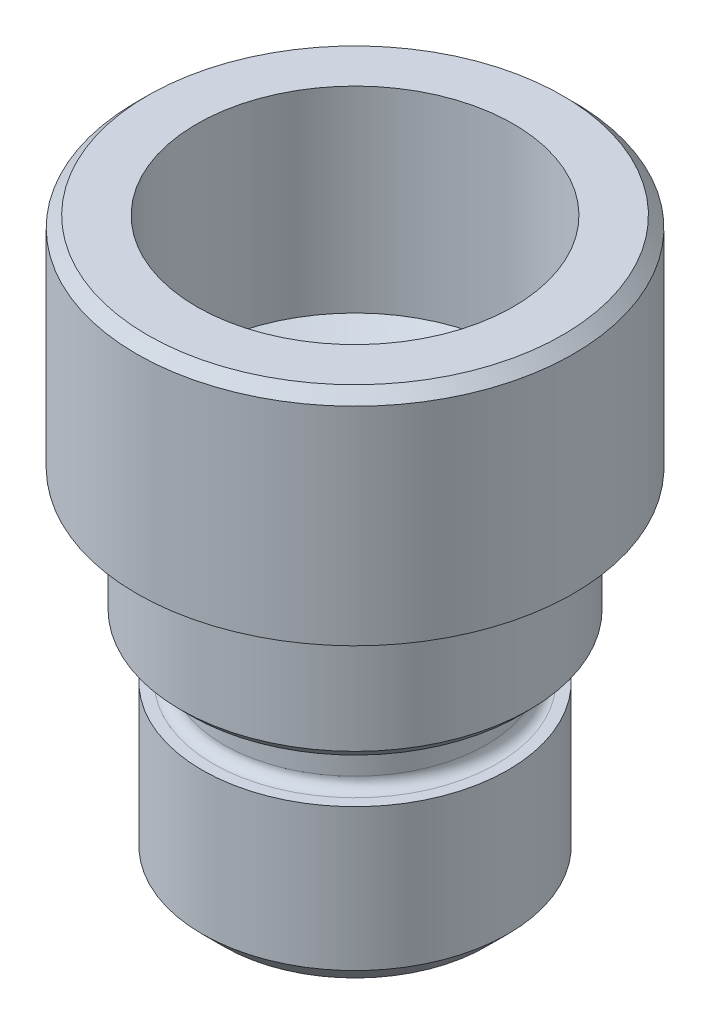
ISO-10303-21;
HEADER;
FILE_DESCRIPTION(('STEP AP214'),'2;1');
FILE_NAME('part.step','',(''),(''),'','','');
FILE_SCHEMA(('AUTOMOTIVE_DESIGN { 1 0 10303 214 1 1 1 1 }'));
ENDSEC;
DATA;
#1=APPLICATION_CONTEXT('core data for automotive mechanical design processes');
#2=APPLICATION_PROTOCOL_DEFINITION('international standard','automotive_design',2000,#1);
#3=PRODUCT_CONTEXT('',#1,'mechanical');
#4=PRODUCT('Part','Part','',(#3));
#5=PRODUCT_RELATED_PRODUCT_CATEGORY('part','',(#4));
#6=PRODUCT_DEFINITION_FORMATION('','',#4);
#7=PRODUCT_DEFINITION_CONTEXT('part definition',#1,'design');
#8=PRODUCT_DEFINITION('design','',#6,#7);
#9=PRODUCT_DEFINITION_SHAPE('','',#8);
#10=(LENGTH_UNIT() NAMED_UNIT(*) SI_UNIT(.MILLI.,.METRE.));
#11=(NAMED_UNIT(*) PLANE_ANGLE_UNIT() SI_UNIT($,.RADIAN.));
#12=(NAMED_UNIT(*) SI_UNIT($,.STERADIAN.) SOLID_ANGLE_UNIT());
#13=UNCERTAINTY_MEASURE_WITH_UNIT(LENGTH_MEASURE(1.E-05),#10,'distance_accuracy_value','');
#14=(GEOMETRIC_REPRESENTATION_CONTEXT(3) GLOBAL_UNCERTAINTY_ASSIGNED_CONTEXT((#13)) GLOBAL_UNIT_ASSIGNED_CONTEXT((#10,
#11,#12)) REPRESENTATION_CONTEXT('',''));
#15=CARTESIAN_POINT('',(0.,0.,0.));
#16=DIRECTION('',(0.,0.,1.));
#17=DIRECTION('',(1.,0.,0.));
#18=AXIS2_PLACEMENT_3D('',#15,#16,#17);
#19=CARTESIAN_POINT('',(0.,8.,0.));
#20=DIRECTION('',(0.,1.,0.));
#21=DIRECTION('',(0.,0.,1.));
#22=AXIS2_PLACEMENT_3D('',#19,#20,#21);
#23=TOROIDAL_SURFACE('',#22,6.5,0.500000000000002);
#24=CARTESIAN_POINT('',(0.,7.5,0.));
#25=DIRECTION('',(0.,1.,0.));
#26=DIRECTION('',(0.,0.,1.));
#27=AXIS2_PLACEMENT_3D('',#24,#25,#26);
#28=CIRCLE('',#27,6.5);
#29=CARTESIAN_POINT('',(0.,7.5,6.5));
#30=VERTEX_POINT('',#29);
#31=EDGE_CURVE('E76',#30,#30,#28,.T.);
#32=ORIENTED_EDGE('',*,*,#31,.T.);
#33=EDGE_LOOP('',(#32));
#34=FACE_BOUND('',#33,.T.);
#35=CARTESIAN_POINT('',(0.,8.,0.));
#36=DIRECTION('',(0.,1.,0.));
#37=DIRECTION('',(0.,0.,1.));
#38=AXIS2_PLACEMENT_3D('',#35,#36,#37);
#39=CIRCLE('',#38,6.);
#40=CARTESIAN_POINT('',(0.,8.,6.));
#41=VERTEX_POINT('',#40);
#42=EDGE_CURVE('E10',#41,#41,#39,.T.);
#43=ORIENTED_EDGE('',*,*,#42,.F.);
#44=EDGE_LOOP('',(#43));
#45=FACE_BOUND('',#44,.T.);
#46=ADVANCED_FACE('F30',(#34,#45),#23,.F.);
#47=CARTESIAN_POINT('',(0.,0.,0.));
#48=DIRECTION('',(0.,1.,0.));
#49=DIRECTION('',(0.,0.,1.));
#50=AXIS2_PLACEMENT_3D('',#47,#48,#49);
#51=CYLINDRICAL_SURFACE('',#50,6.);
#52=ORIENTED_EDGE('',*,*,#42,.T.);
#53=EDGE_LOOP('',(#52));
#54=FACE_BOUND('',#53,.T.);
#55=CARTESIAN_POINT('',(0.,9.4,0.));
#56=DIRECTION('',(0.,1.,0.));
#57=DIRECTION('',(0.,0.,1.));
#58=AXIS2_PLACEMENT_3D('',#55,#56,#57);
#59=CIRCLE('',#58,6.);
#60=CARTESIAN_POINT('',(0.,9.4,6.));
#61=VERTEX_POINT('',#60);
#62=EDGE_CURVE('E37',#61,#61,#59,.T.);
#63=ORIENTED_EDGE('',*,*,#62,.F.);
#64=EDGE_LOOP('',(#63));
#65=FACE_BOUND('',#64,.T.);
#66=ADVANCED_FACE('F107',(#54,#65),#51,.T.);
#67=CARTESIAN_POINT('',(0.,9.4,0.));
#68=DIRECTION('',(0.,1.,0.));
#69=DIRECTION('',(0.,0.,1.));
#70=AXIS2_PLACEMENT_3D('',#67,#68,#69);
#71=TOROIDAL_SURFACE('',#70,6.5,0.5);
#72=ORIENTED_EDGE('',*,*,#62,.T.);
#73=EDGE_LOOP('',(#72));
#74=FACE_BOUND('',#73,.T.);
#75=CARTESIAN_POINT('',(0.,9.9,0.));
#76=DIRECTION('',(0.,1.,0.));
#77=DIRECTION('',(0.,0.,1.));
#78=AXIS2_PLACEMENT_3D('',#75,#76,#77);
#79=CIRCLE('',#78,6.5);
#80=CARTESIAN_POINT('',(0.,9.9,6.5));
#81=VERTEX_POINT('',#80);
#82=EDGE_CURVE('E41',#81,#81,#79,.T.);
#83=ORIENTED_EDGE('',*,*,#82,.F.);
#84=EDGE_LOOP('',(#83));
#85=FACE_BOUND('',#84,.T.);
#86=ADVANCED_FACE('F112',(#74,#85),#71,.F.);
#87=CARTESIAN_POINT('',(7.5,9.9,0.));
#88=DIRECTION('',(0.,-1.,0.));
#89=DIRECTION('',(0.,0.,-1.));
#90=AXIS2_PLACEMENT_3D('',#87,#88,#89);
#91=PLANE('',#90);
#92=ORIENTED_EDGE('',*,*,#82,.T.);
#93=EDGE_LOOP('',(#92));
#94=FACE_BOUND('',#93,.T.);
#95=CARTESIAN_POINT('',(0.,9.9,0.));
#96=DIRECTION('',(0.,1.,0.));
#97=DIRECTION('',(0.,0.,1.));
#98=AXIS2_PLACEMENT_3D('',#95,#96,#97);
#99=CIRCLE('',#98,7.5);
#100=CARTESIAN_POINT('',(0.,9.9,7.5));
#101=VERTEX_POINT('',#100);
#102=EDGE_CURVE('E46',#101,#101,#99,.T.);
#103=ORIENTED_EDGE('',*,*,#102,.F.);
#104=EDGE_LOOP('',(#103));
#105=FACE_BOUND('',#104,.T.);
#106=ADVANCED_FACE('F239',(#94,#105),#91,.T.);
#107=CARTESIAN_POINT('',(0.,10.4,0.));
#108=DIRECTION('',(0.,1.,0.));
#109=DIRECTION('',(0.,0.,1.));
#110=AXIS2_PLACEMENT_3D('',#107,#108,#109);
#111=CONICAL_SURFACE('',#110,8.,0.785398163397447);
#112=ORIENTED_EDGE('',*,*,#102,.T.);
#113=EDGE_LOOP('',(#112));
#114=FACE_BOUND('',#113,.T.);
#115=CARTESIAN_POINT('',(0.,10.4,0.));
#116=DIRECTION('',(0.,1.,0.));
#117=DIRECTION('',(0.,0.,1.));
#118=AXIS2_PLACEMENT_3D('',#115,#116,#117);
#119=CIRCLE('',#118,8.);
#120=CARTESIAN_POINT('',(0.,10.4,8.));
#121=VERTEX_POINT('',#120);
#122=EDGE_CURVE('E49',#121,#121,#119,.T.);
#123=ORIENTED_EDGE('',*,*,#122,.F.);
#124=EDGE_LOOP('',(#123));
#125=FACE_BOUND('',#124,.T.);
#126=ADVANCED_FACE('F229',(#114,#125),#111,.T.);
#127=CARTESIAN_POINT('',(0.,0.,0.));
#128=DIRECTION('',(0.,1.,0.));
#129=DIRECTION('',(0.,0.,1.));
#130=AXIS2_PLACEMENT_3D('',#127,#128,#129);
#131=CYLINDRICAL_SURFACE('',#130,8.);
#132=ORIENTED_EDGE('',*,*,#122,.T.);
#133=EDGE_LOOP('',(#132));
#134=FACE_BOUND('',#133,.T.);
#135=CARTESIAN_POINT('',(0.,16.,0.));
#136=DIRECTION('',(0.,1.,0.));
#137=DIRECTION('',(0.,0.,1.));
#138=AXIS2_PLACEMENT_3D('',#135,#136,#137);
#139=CIRCLE('',#138,8.);
#140=CARTESIAN_POINT('',(0.,16.,8.));
#141=VERTEX_POINT('',#140);
#142=EDGE_CURVE('E52',#141,#141,#139,.T.);
#143=ORIENTED_EDGE('',*,*,#142,.F.);
#144=EDGE_LOOP('',(#143));
#145=FACE_BOUND('',#144,.T.);
#146=ADVANCED_FACE('F219',(#134,#145),#131,.T.);
#147=CARTESIAN_POINT('',(10.,16.,0.));
#148=DIRECTION('',(0.,-1.,0.));
#149=DIRECTION('',(0.,0.,-1.));
#150=AXIS2_PLACEMENT_3D('',#147,#148,#149);
#151=PLANE('',#150);
#152=ORIENTED_EDGE('',*,*,#142,.T.);
#153=EDGE_LOOP('',(#152));
#154=FACE_BOUND('',#153,.T.);
#155=CARTESIAN_POINT('',(0.,16.,0.));
#156=DIRECTION('',(0.,1.,0.));
#157=DIRECTION('',(0.,0.,1.));
#158=AXIS2_PLACEMENT_3D('',#155,#156,#157);
#159=CIRCLE('',#158,10.);
#160=CARTESIAN_POINT('',(0.,16.,10.));
#161=VERTEX_POINT('',#160);
#162=EDGE_CURVE('E55',#161,#161,#159,.T.);
#163=ORIENTED_EDGE('',*,*,#162,.F.);
#164=EDGE_LOOP('',(#163));
#165=FACE_BOUND('',#164,.T.);
#166=ADVANCED_FACE('F103',(#154,#165),#151,.T.);
#167=CARTESIAN_POINT('',(0.,0.,0.));
#168=DIRECTION('',(0.,1.,0.));
#169=DIRECTION('',(0.,0.,1.));
#170=AXIS2_PLACEMENT_3D('',#167,#168,#169);
#171=CYLINDRICAL_SURFACE('',#170,10.);
#172=ORIENTED_EDGE('',*,*,#162,.T.);
#173=EDGE_LOOP('',(#172));
#174=FACE_BOUND('',#173,.T.);
#175=CARTESIAN_POINT('',(0.,25.5,0.));
#176=DIRECTION('',(0.,1.,0.));
#177=DIRECTION('',(0.,0.,1.));
#178=AXIS2_PLACEMENT_3D('',#175,#176,#177);
#179=CIRCLE('',#178,10.);
#180=CARTESIAN_POINT('',(0.,25.5,10.));
#181=VERTEX_POINT('',#180);
#182=EDGE_CURVE('E58',#181,#181,#179,.T.);
#183=ORIENTED_EDGE('',*,*,#182,.F.);
#184=EDGE_LOOP('',(#183));
#185=FACE_BOUND('',#184,.T.);
#186=ADVANCED_FACE('F97',(#174,#185),#171,.T.);
#187=CARTESIAN_POINT('',(0.,26.,0.));
#188=DIRECTION('',(0.,-1.,0.));
#189=DIRECTION('',(0.,0.,-1.));
#190=AXIS2_PLACEMENT_3D('',#187,#188,#189);
#191=CONICAL_SURFACE('',#190,9.5,0.785398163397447);
#192=ORIENTED_EDGE('',*,*,#182,.T.);
#193=EDGE_LOOP('',(#192));
#194=FACE_BOUND('',#193,.T.);
#195=CARTESIAN_POINT('',(0.,26.,0.));
#196=DIRECTION('',(0.,1.,0.));
#197=DIRECTION('',(0.,0.,1.));
#198=AXIS2_PLACEMENT_3D('',#195,#196,#197);
#199=CIRCLE('',#198,9.5);
#200=CARTESIAN_POINT('',(0.,26.,9.5));
#201=VERTEX_POINT('',#200);
#202=EDGE_CURVE('E61',#201,#201,#199,.T.);
#203=ORIENTED_EDGE('',*,*,#202,.F.);
#204=EDGE_LOOP('',(#203));
#205=FACE_BOUND('',#204,.T.);
#206=ADVANCED_FACE('F92',(#194,#205),#191,.T.);
#207=CARTESIAN_POINT('',(6.5,26.,0.));
#208=DIRECTION('',(0.,1.,0.));
#209=DIRECTION('',(0.,0.,1.));
#210=AXIS2_PLACEMENT_3D('',#207,#208,#209);
#211=PLANE('',#210);
#212=CARTESIAN_POINT('',(0.,26.,0.));
#213=DIRECTION('',(0.,1.,0.));
#214=DIRECTION('',(0.,0.,1.));
#215=AXIS2_PLACEMENT_3D('',#212,#213,#214);
#216=CIRCLE('',#215,7.24999999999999);
#217=CARTESIAN_POINT('',(0.,26.,7.24999999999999));
#218=VERTEX_POINT('',#217);
#219=EDGE_CURVE('E82',#218,#218,#216,.T.);
#220=ORIENTED_EDGE('',*,*,#219,.F.);
#221=EDGE_LOOP('',(#220));
#222=FACE_BOUND('',#221,.T.);
#223=ORIENTED_EDGE('',*,*,#202,.T.);
#224=EDGE_LOOP('',(#223));
#225=FACE_BOUND('',#224,.T.);
#226=ADVANCED_FACE('F88',(#222,#225),#211,.T.);
#227=CARTESIAN_POINT('',(0.,0.,0.));
#228=DIRECTION('',(0.,1.,0.));
#229=DIRECTION('',(0.,0.,1.));
#230=AXIS2_PLACEMENT_3D('',#227,#228,#229);
#231=CYLINDRICAL_SURFACE('',#230,5.);
#232=CARTESIAN_POINT('',(0.,15.648063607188,0.));
#233=DIRECTION('',(0.,1.,0.));
#234=DIRECTION('',(0.,0.,1.));
#235=AXIS2_PLACEMENT_3D('',#232,#233,#234);
#236=CIRCLE('',#235,5.);
#237=CARTESIAN_POINT('',(0.,15.648063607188,5.));
#238=VERTEX_POINT('',#237);
#239=EDGE_CURVE('E33',#238,#238,#236,.F.);
#240=ORIENTED_EDGE('',*,*,#239,.F.);
#241=EDGE_LOOP('',(#240));
#242=FACE_BOUND('',#241,.T.);
#243=CARTESIAN_POINT('',(0.,0.,0.));
#244=DIRECTION('',(0.,1.,0.));
#245=DIRECTION('',(0.,0.,1.));
#246=AXIS2_PLACEMENT_3D('',#243,#244,#245);
#247=CIRCLE('',#246,5.);
#248=CARTESIAN_POINT('',(0.,0.,5.));
#249=VERTEX_POINT('',#248);
#250=EDGE_CURVE('E64',#249,#249,#247,.T.);
#251=ORIENTED_EDGE('',*,*,#250,.F.);
#252=EDGE_LOOP('',(#251));
#253=FACE_BOUND('',#252,.T.);
#254=ADVANCED_FACE('F91',(#242,#253),#231,.F.);
#255=CARTESIAN_POINT('',(6.,0.,0.));
#256=DIRECTION('',(0.,-1.,0.));
#257=DIRECTION('',(0.,0.,-1.));
#258=AXIS2_PLACEMENT_3D('',#255,#256,#257);
#259=PLANE('',#258);
#260=ORIENTED_EDGE('',*,*,#250,.T.);
#261=EDGE_LOOP('',(#260));
#262=FACE_BOUND('',#261,.T.);
#263=CARTESIAN_POINT('',(0.,0.,0.));
#264=DIRECTION('',(0.,1.,0.));
#265=DIRECTION('',(0.,0.,1.));
#266=AXIS2_PLACEMENT_3D('',#263,#264,#265);
#267=CIRCLE('',#266,6.);
#268=CARTESIAN_POINT('',(0.,0.,6.));
#269=VERTEX_POINT('',#268);
#270=EDGE_CURVE('E67',#269,#269,#267,.T.);
#271=ORIENTED_EDGE('',*,*,#270,.F.);
#272=EDGE_LOOP('',(#271));
#273=FACE_BOUND('',#272,.T.);
#274=ADVANCED_FACE('F135',(#262,#273),#259,.T.);
#275=CARTESIAN_POINT('',(0.,1.,0.));
#276=DIRECTION('',(0.,1.,0.));
#277=DIRECTION('',(0.,0.,1.));
#278=AXIS2_PLACEMENT_3D('',#275,#276,#277);
#279=CONICAL_SURFACE('',#278,7.,0.785398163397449);
#280=ORIENTED_EDGE('',*,*,#270,.T.);
#281=EDGE_LOOP('',(#280));
#282=FACE_BOUND('',#281,.T.);
#283=CARTESIAN_POINT('',(0.,1.,0.));
#284=DIRECTION('',(0.,1.,0.));
#285=DIRECTION('',(0.,0.,1.));
#286=AXIS2_PLACEMENT_3D('',#283,#284,#285);
#287=CIRCLE('',#286,7.);
#288=CARTESIAN_POINT('',(0.,1.,7.));
#289=VERTEX_POINT('',#288);
#290=EDGE_CURVE('E70',#289,#289,#287,.T.);
#291=ORIENTED_EDGE('',*,*,#290,.F.);
#292=EDGE_LOOP('',(#291));
#293=FACE_BOUND('',#292,.T.);
#294=ADVANCED_FACE('F128',(#282,#293),#279,.T.);
#295=CARTESIAN_POINT('',(0.,0.,0.));
#296=DIRECTION('',(0.,1.,0.));
#297=DIRECTION('',(0.,0.,1.));
#298=AXIS2_PLACEMENT_3D('',#295,#296,#297);
#299=CYLINDRICAL_SURFACE('',#298,7.);
#300=ORIENTED_EDGE('',*,*,#290,.T.);
#301=EDGE_LOOP('',(#300));
#302=FACE_BOUND('',#301,.T.);
#303=CARTESIAN_POINT('',(0.,7.5,0.));
#304=DIRECTION('',(0.,1.,0.));
#305=DIRECTION('',(0.,0.,1.));
#306=AXIS2_PLACEMENT_3D('',#303,#304,#305);
#307=CIRCLE('',#306,7.);
#308=CARTESIAN_POINT('',(0.,7.5,7.));
#309=VERTEX_POINT('',#308);
#310=EDGE_CURVE('E73',#309,#309,#307,.T.);
#311=ORIENTED_EDGE('',*,*,#310,.F.);
#312=EDGE_LOOP('',(#311));
#313=FACE_BOUND('',#312,.T.);
#314=ADVANCED_FACE('F119',(#302,#313),#299,.T.);
#315=CARTESIAN_POINT('',(6.5,7.5,0.));
#316=DIRECTION('',(0.,1.,0.));
#317=DIRECTION('',(0.,0.,1.));
#318=AXIS2_PLACEMENT_3D('',#315,#316,#317);
#319=PLANE('',#318);
#320=ORIENTED_EDGE('',*,*,#310,.T.);
#321=EDGE_LOOP('',(#320));
#322=FACE_BOUND('',#321,.T.);
#323=ORIENTED_EDGE('',*,*,#31,.F.);
#324=EDGE_LOOP('',(#323));
#325=FACE_BOUND('',#324,.T.);
#326=ADVANCED_FACE('F116',(#322,#325),#319,.T.);
#327=CARTESIAN_POINT('',(0.,17.,0.));
#328=DIRECTION('',(0.,1.,0.));
#329=DIRECTION('',(0.,0.,1.));
#330=AXIS2_PLACEMENT_3D('',#327,#328,#329);
#331=CONICAL_SURFACE('',#330,7.25,1.02974425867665);
#332=ORIENTED_EDGE('',*,*,#239,.T.);
#333=EDGE_LOOP('',(#332));
#334=FACE_BOUND('',#333,.T.);
#335=CARTESIAN_POINT('',(0.,17.,0.));
#336=DIRECTION('',(0.,1.,0.));
#337=DIRECTION('',(0.,0.,1.));
#338=AXIS2_PLACEMENT_3D('',#335,#336,#337);
#339=CIRCLE('',#338,7.25);
#340=CARTESIAN_POINT('',(0.,17.,7.25));
#341=VERTEX_POINT('',#340);
#342=EDGE_CURVE('E79',#341,#341,#339,.T.);
#343=ORIENTED_EDGE('',*,*,#342,.T.);
#344=EDGE_LOOP('',(#343));
#345=FACE_BOUND('',#344,.T.);
#346=ADVANCED_FACE('F118',(#334,#345),#331,.F.);
#347=CARTESIAN_POINT('',(0.,26.,0.));
#348=DIRECTION('',(0.,1.,0.));
#349=DIRECTION('',(0.,0.,1.));
#350=AXIS2_PLACEMENT_3D('',#347,#348,#349);
#351=CYLINDRICAL_SURFACE('',#350,7.24999999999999);
#352=ORIENTED_EDGE('',*,*,#342,.F.);
#353=EDGE_LOOP('',(#352));
#354=FACE_BOUND('',#353,.T.);
#355=ORIENTED_EDGE('',*,*,#219,.T.);
#356=EDGE_LOOP('',(#355));
#357=FACE_BOUND('',#356,.T.);
#358=ADVANCED_FACE('F86',(#354,#357),#351,.F.);
#359=CLOSED_SHELL('',(#46,#66,#86,#106,#126,#146,#166,#186,#206,#226,#254,#274,#294,#314,#326,
#346,#358));
#360=MANIFOLD_SOLID_BREP('B2',#359);
#361=ADVANCED_BREP_SHAPE_REPRESENTATION('',(#18,#360),#14);
#362=SHAPE_DEFINITION_REPRESENTATION(#9,#361);
ENDSEC;
END-ISO-10303-21;
